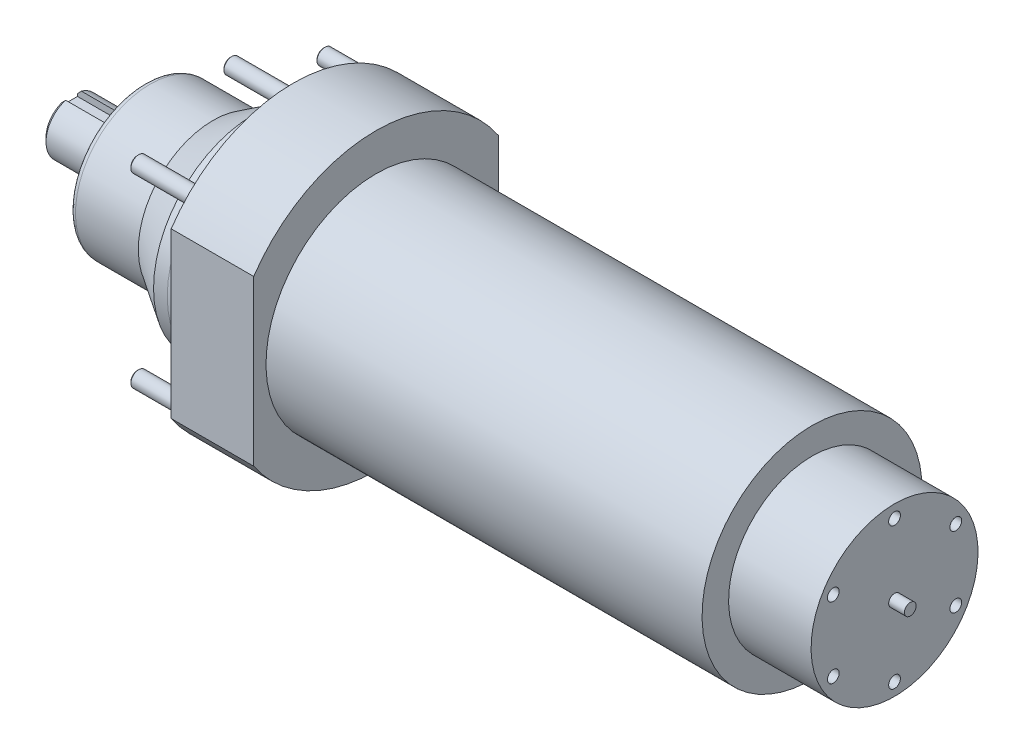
ISO-10303-21;
HEADER;
FILE_DESCRIPTION(('STEP AP214'),'2;1');
FILE_NAME('part.step','',(''),(''),'','','');
FILE_SCHEMA(('AUTOMOTIVE_DESIGN { 1 0 10303 214 1 1 1 1 }'));
ENDSEC;
DATA;
#1=APPLICATION_CONTEXT('core data for automotive mechanical design processes');
#2=APPLICATION_PROTOCOL_DEFINITION('international standard','automotive_design',2000,#1);
#3=PRODUCT_CONTEXT('',#1,'mechanical');
#4=PRODUCT('Part','Part','',(#3));
#5=PRODUCT_RELATED_PRODUCT_CATEGORY('part','',(#4));
#6=PRODUCT_DEFINITION_FORMATION('','',#4);
#7=PRODUCT_DEFINITION_CONTEXT('part definition',#1,'design');
#8=PRODUCT_DEFINITION('design','',#6,#7);
#9=PRODUCT_DEFINITION_SHAPE('','',#8);
#10=(LENGTH_UNIT() NAMED_UNIT(*) SI_UNIT(.MILLI.,.METRE.));
#11=(NAMED_UNIT(*) PLANE_ANGLE_UNIT() SI_UNIT($,.RADIAN.));
#12=(NAMED_UNIT(*) SI_UNIT($,.STERADIAN.) SOLID_ANGLE_UNIT());
#13=UNCERTAINTY_MEASURE_WITH_UNIT(LENGTH_MEASURE(1.E-05),#10,'distance_accuracy_value','');
#14=(GEOMETRIC_REPRESENTATION_CONTEXT(3) GLOBAL_UNCERTAINTY_ASSIGNED_CONTEXT((#13)) GLOBAL_UNIT_ASSIGNED_CONTEXT((#10,
#11,#12)) REPRESENTATION_CONTEXT('',''));
#15=CARTESIAN_POINT('',(0.,0.,0.));
#16=DIRECTION('',(0.,0.,1.));
#17=DIRECTION('',(1.,0.,0.));
#18=AXIS2_PLACEMENT_3D('',#15,#16,#17);
#19=CARTESIAN_POINT('',(80.,0.,0.));
#20=DIRECTION('',(1.,0.,0.));
#21=DIRECTION('',(0.,1.,0.));
#22=AXIS2_PLACEMENT_3D('',#19,#20,#21);
#23=CYLINDRICAL_SURFACE('',#22,75.);
#24=CARTESIAN_POINT('',(-230.247442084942,0.,0.));
#25=DIRECTION('',(1.,0.,0.));
#26=DIRECTION('',(0.,1.,0.));
#27=AXIS2_PLACEMENT_3D('',#24,#25,#26);
#28=CIRCLE('',#27,75.);
#29=CARTESIAN_POINT('',(-230.247442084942,-41.832254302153,62.25));
#30=VERTEX_POINT('',#29);
#31=CARTESIAN_POINT('',(-230.247442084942,-41.832254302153,-62.25));
#32=VERTEX_POINT('',#31);
#33=EDGE_CURVE('E117',#30,#32,#28,.T.);
#34=ORIENTED_EDGE('',*,*,#33,.T.);
#35=DIRECTION('',(1.,0.,0.));
#36=VECTOR('',#35,1.);
#37=CARTESIAN_POINT('',(-344.247442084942,-41.832254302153,-62.25));
#38=LINE('',#37,#36);
#39=CARTESIAN_POINT('',(-188.247442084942,-41.832254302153,-62.25));
#40=VERTEX_POINT('',#39);
#41=EDGE_CURVE('E43',#32,#40,#38,.T.);
#42=ORIENTED_EDGE('',*,*,#41,.T.);
#43=CARTESIAN_POINT('',(-188.247442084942,0.,0.));
#44=DIRECTION('',(1.,0.,0.));
#45=DIRECTION('',(0.,1.,0.));
#46=AXIS2_PLACEMENT_3D('',#43,#44,#45);
#47=CIRCLE('',#46,75.);
#48=CARTESIAN_POINT('',(-188.247442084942,-41.832254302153,62.25));
#49=VERTEX_POINT('',#48);
#50=EDGE_CURVE('E112',#49,#40,#47,.T.);
#51=ORIENTED_EDGE('',*,*,#50,.F.);
#52=DIRECTION('',(1.,0.,0.));
#53=VECTOR('',#52,1.);
#54=CARTESIAN_POINT('',(-344.247442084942,-41.832254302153,62.25));
#55=LINE('',#54,#53);
#56=EDGE_CURVE('E544',#30,#49,#55,.T.);
#57=ORIENTED_EDGE('',*,*,#56,.F.);
#58=EDGE_LOOP('',(#34,#42,#51,#57));
#59=FACE_BOUND('',#58,.T.);
#60=ADVANCED_FACE('F28',(#59),#23,.T.);
#61=CARTESIAN_POINT('',(-188.247442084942,75.,0.));
#62=DIRECTION('',(-1.,0.,0.));
#63=DIRECTION('',(0.,-1.,0.));
#64=AXIS2_PLACEMENT_3D('',#61,#62,#63);
#65=PLANE('',#64);
#66=CARTESIAN_POINT('',(-188.247442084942,0.,0.));
#67=DIRECTION('',(1.,0.,0.));
#68=DIRECTION('',(0.,1.,0.));
#69=AXIS2_PLACEMENT_3D('',#66,#67,#68);
#70=CIRCLE('',#69,56.);
#71=CARTESIAN_POINT('',(-188.247442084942,56.,0.));
#72=VERTEX_POINT('',#71);
#73=EDGE_CURVE('E119',#72,#72,#70,.T.);
#74=ORIENTED_EDGE('',*,*,#73,.F.);
#75=EDGE_LOOP('',(#74));
#76=FACE_BOUND('',#75,.T.);
#77=ORIENTED_EDGE('',*,*,#50,.T.);
#78=DIRECTION('',(0.,-1.,0.));
#79=VECTOR('',#78,1.);
#80=CARTESIAN_POINT('',(-188.247442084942,41.832254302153,-62.25));
#81=LINE('',#80,#79);
#82=CARTESIAN_POINT('',(-188.247442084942,41.832254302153,-62.25));
#83=VERTEX_POINT('',#82);
#84=EDGE_CURVE('E101',#83,#40,#81,.T.);
#85=ORIENTED_EDGE('',*,*,#84,.F.);
#86=CARTESIAN_POINT('',(-188.247442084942,41.8322543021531,62.25));
#87=VERTEX_POINT('',#86);
#88=EDGE_CURVE('E109',#83,#87,#47,.T.);
#89=ORIENTED_EDGE('',*,*,#88,.T.);
#90=DIRECTION('',(0.,-1.,0.));
#91=VECTOR('',#90,1.);
#92=CARTESIAN_POINT('',(-188.247442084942,41.8322543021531,62.25));
#93=LINE('',#92,#91);
#94=EDGE_CURVE('E546',#87,#49,#93,.T.);
#95=ORIENTED_EDGE('',*,*,#94,.T.);
#96=EDGE_LOOP('',(#77,#85,#89,#95));
#97=FACE_BOUND('',#96,.T.);
#98=ADVANCED_FACE('F107',(#76,#97),#65,.F.);
#99=ORIENTED_EDGE('',*,*,#88,.F.);
#100=DIRECTION('',(1.,0.,0.));
#101=VECTOR('',#100,1.);
#102=CARTESIAN_POINT('',(-344.247442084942,41.8322543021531,-62.25));
#103=LINE('',#102,#101);
#104=CARTESIAN_POINT('',(-230.247442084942,41.8322543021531,-62.25));
#105=VERTEX_POINT('',#104);
#106=EDGE_CURVE('E98',#105,#83,#103,.T.);
#107=ORIENTED_EDGE('',*,*,#106,.F.);
#108=CARTESIAN_POINT('',(-230.247442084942,41.832254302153,62.25));
#109=VERTEX_POINT('',#108);
#110=EDGE_CURVE('E51',#105,#109,#28,.T.);
#111=ORIENTED_EDGE('',*,*,#110,.T.);
#112=DIRECTION('',(1.,0.,0.));
#113=VECTOR('',#112,1.);
#114=CARTESIAN_POINT('',(-344.247442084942,41.8322543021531,62.25));
#115=LINE('',#114,#113);
#116=EDGE_CURVE('E116',#109,#87,#115,.T.);
#117=ORIENTED_EDGE('',*,*,#116,.T.);
#118=EDGE_LOOP('',(#99,#107,#111,#117));
#119=FACE_BOUND('',#118,.T.);
#120=ADVANCED_FACE('F115',(#119),#23,.T.);
#121=CARTESIAN_POINT('',(-230.247442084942,52.5,0.));
#122=DIRECTION('',(1.,0.,0.));
#123=DIRECTION('',(0.,1.,0.));
#124=AXIS2_PLACEMENT_3D('',#121,#122,#123);
#125=PLANE('',#124);
#126=CARTESIAN_POINT('',(-230.247442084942,-47.3761543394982,47.3761543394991));
#127=DIRECTION('',(1.,0.,0.));
#128=DIRECTION('',(0.,1.,0.));
#129=AXIS2_PLACEMENT_3D('',#126,#127,#128);
#130=CIRCLE('',#129,4.00000000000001);
#131=CARTESIAN_POINT('',(-230.247442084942,-43.3761543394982,47.3761543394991));
#132=VERTEX_POINT('',#131);
#133=EDGE_CURVE('E319',#132,#132,#130,.T.);
#134=ORIENTED_EDGE('',*,*,#133,.T.);
#135=EDGE_LOOP('',(#134));
#136=FACE_BOUND('',#135,.T.);
#137=CARTESIAN_POINT('',(-230.247442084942,-67.,4.67858770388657E-13));
#138=DIRECTION('',(1.,0.,0.));
#139=DIRECTION('',(0.,1.,0.));
#140=AXIS2_PLACEMENT_3D('',#137,#138,#139);
#141=CIRCLE('',#140,4.);
#142=CARTESIAN_POINT('',(-230.247442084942,-63.,4.67858770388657E-13));
#143=VERTEX_POINT('',#142);
#144=EDGE_CURVE('E316',#143,#143,#141,.T.);
#145=ORIENTED_EDGE('',*,*,#144,.T.);
#146=EDGE_LOOP('',(#145));
#147=FACE_BOUND('',#146,.T.);
#148=CARTESIAN_POINT('',(-230.247442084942,-47.3761543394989,-47.3761543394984));
#149=DIRECTION('',(1.,0.,0.));
#150=DIRECTION('',(0.,1.,0.));
#151=AXIS2_PLACEMENT_3D('',#148,#149,#150);
#152=CIRCLE('',#151,4.00000000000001);
#153=CARTESIAN_POINT('',(-230.247442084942,-43.3761543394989,-47.3761543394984));
#154=VERTEX_POINT('',#153);
#155=EDGE_CURVE('E313',#154,#154,#152,.T.);
#156=ORIENTED_EDGE('',*,*,#155,.T.);
#157=EDGE_LOOP('',(#156));
#158=FACE_BOUND('',#157,.T.);
#159=CARTESIAN_POINT('',(-230.247442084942,47.3761543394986,-47.3761543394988));
#160=DIRECTION('',(1.,0.,0.));
#161=DIRECTION('',(0.,1.,0.));
#162=AXIS2_PLACEMENT_3D('',#159,#160,#161);
#163=CIRCLE('',#162,4.);
#164=CARTESIAN_POINT('',(-230.247442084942,51.3761543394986,-47.3761543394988));
#165=VERTEX_POINT('',#164);
#166=EDGE_CURVE('E310',#165,#165,#163,.T.);
#167=ORIENTED_EDGE('',*,*,#166,.T.);
#168=EDGE_LOOP('',(#167));
#169=FACE_BOUND('',#168,.T.);
#170=CARTESIAN_POINT('',(-230.247442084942,67.,0.));
#171=DIRECTION('',(1.,0.,0.));
#172=DIRECTION('',(0.,1.,0.));
#173=AXIS2_PLACEMENT_3D('',#170,#171,#172);
#174=CIRCLE('',#173,4.);
#175=CARTESIAN_POINT('',(-230.247442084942,71.,0.));
#176=VERTEX_POINT('',#175);
#177=EDGE_CURVE('E307',#176,#176,#174,.T.);
#178=ORIENTED_EDGE('',*,*,#177,.T.);
#179=EDGE_LOOP('',(#178));
#180=FACE_BOUND('',#179,.T.);
#181=CARTESIAN_POINT('',(-230.247442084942,47.3761543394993,47.3761543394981));
#182=DIRECTION('',(1.,0.,0.));
#183=DIRECTION('',(0.,1.,0.));
#184=AXIS2_PLACEMENT_3D('',#181,#182,#183);
#185=CIRCLE('',#184,4.);
#186=CARTESIAN_POINT('',(-230.247442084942,51.3761543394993,47.3761543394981));
#187=VERTEX_POINT('',#186);
#188=EDGE_CURVE('E303',#187,#187,#185,.T.);
#189=ORIENTED_EDGE('',*,*,#188,.T.);
#190=EDGE_LOOP('',(#189));
#191=FACE_BOUND('',#190,.T.);
#192=CARTESIAN_POINT('',(-230.247442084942,0.,0.));
#193=DIRECTION('',(1.,0.,0.));
#194=DIRECTION('',(0.,1.,0.));
#195=AXIS2_PLACEMENT_3D('',#192,#193,#194);
#196=CIRCLE('',#195,52.5);
#197=CARTESIAN_POINT('',(-230.247442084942,52.5,0.));
#198=VERTEX_POINT('',#197);
#199=EDGE_CURVE('E279',#198,#198,#196,.T.);
#200=ORIENTED_EDGE('',*,*,#199,.T.);
#201=EDGE_LOOP('',(#200));
#202=FACE_BOUND('',#201,.T.);
#203=ORIENTED_EDGE('',*,*,#110,.F.);
#204=DIRECTION('',(0.,-1.,0.));
#205=VECTOR('',#204,1.);
#206=CARTESIAN_POINT('',(-230.247442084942,52.5,-62.25));
#207=LINE('',#206,#205);
#208=EDGE_CURVE('E102',#105,#32,#207,.T.);
#209=ORIENTED_EDGE('',*,*,#208,.T.);
#210=ORIENTED_EDGE('',*,*,#33,.F.);
#211=DIRECTION('',(0.,-1.,0.));
#212=VECTOR('',#211,1.);
#213=CARTESIAN_POINT('',(-230.247442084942,52.5,62.25));
#214=LINE('',#213,#212);
#215=EDGE_CURVE('E291',#109,#30,#214,.T.);
#216=ORIENTED_EDGE('',*,*,#215,.F.);
#217=EDGE_LOOP('',(#203,#209,#210,#216));
#218=FACE_BOUND('',#217,.T.);
#219=ADVANCED_FACE('F194',(#136,#147,#158,#169,#180,#191,#202,#218),#125,.F.);
#220=CARTESIAN_POINT('',(75.7525579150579,42.5,0.));
#221=DIRECTION('',(-1.,0.,0.));
#222=DIRECTION('',(0.,-1.,0.));
#223=AXIS2_PLACEMENT_3D('',#220,#221,#222);
#224=PLANE('',#223);
#225=CARTESIAN_POINT('',(75.7525579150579,-17.9999999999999,-31.1769145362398));
#226=DIRECTION('',(1.,0.,0.));
#227=DIRECTION('',(0.,0.499999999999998,-0.86602540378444));
#228=AXIS2_PLACEMENT_3D('',#225,#226,#227);
#229=CIRCLE('',#228,3.);
#230=CARTESIAN_POINT('',(75.7525579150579,-16.4999999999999,-33.7749907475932));
#231=VERTEX_POINT('',#230);
#232=EDGE_CURVE('E306',#231,#231,#229,.T.);
#233=ORIENTED_EDGE('',*,*,#232,.F.);
#234=EDGE_LOOP('',(#233));
#235=FACE_BOUND('',#234,.T.);
#236=CARTESIAN_POINT('',(75.7525579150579,36.,-2.42861286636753E-13));
#237=DIRECTION('',(1.,0.,0.));
#238=DIRECTION('',(0.,0.499999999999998,-0.86602540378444));
#239=AXIS2_PLACEMENT_3D('',#236,#237,#238);
#240=CIRCLE('',#239,3.00000000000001);
#241=CARTESIAN_POINT('',(75.7525579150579,37.5,-2.59807621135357));
#242=VERTEX_POINT('',#241);
#243=EDGE_CURVE('E582',#242,#242,#240,.T.);
#244=ORIENTED_EDGE('',*,*,#243,.F.);
#245=EDGE_LOOP('',(#244));
#246=FACE_BOUND('',#245,.T.);
#247=CARTESIAN_POINT('',(75.7525579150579,-17.9999999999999,31.1769145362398));
#248=DIRECTION('',(1.,0.,0.));
#249=DIRECTION('',(0.,0.499999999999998,-0.86602540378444));
#250=AXIS2_PLACEMENT_3D('',#247,#248,#249);
#251=CIRCLE('',#250,3.);
#252=CARTESIAN_POINT('',(75.7525579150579,-16.4999999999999,28.5788383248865));
#253=VERTEX_POINT('',#252);
#254=EDGE_CURVE('E576',#253,#253,#251,.T.);
#255=ORIENTED_EDGE('',*,*,#254,.F.);
#256=EDGE_LOOP('',(#255));
#257=FACE_BOUND('',#256,.T.);
#258=CARTESIAN_POINT('',(75.7525579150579,18.0000000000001,-31.1769145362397));
#259=DIRECTION('',(1.,0.,0.));
#260=DIRECTION('',(0.,1.,0.));
#261=AXIS2_PLACEMENT_3D('',#258,#259,#260);
#262=CIRCLE('',#261,3.);
#263=CARTESIAN_POINT('',(75.7525579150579,21.0000000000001,-31.1769145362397));
#264=VERTEX_POINT('',#263);
#265=EDGE_CURVE('E564',#264,#264,#262,.T.);
#266=ORIENTED_EDGE('',*,*,#265,.F.);
#267=EDGE_LOOP('',(#266));
#268=FACE_BOUND('',#267,.T.);
#269=CARTESIAN_POINT('',(75.7525579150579,18.0000000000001,31.1769145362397));
#270=DIRECTION('',(1.,0.,0.));
#271=DIRECTION('',(0.,1.,0.));
#272=AXIS2_PLACEMENT_3D('',#269,#270,#271);
#273=CIRCLE('',#272,3.00000000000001);
#274=CARTESIAN_POINT('',(75.7525579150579,21.0000000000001,31.1769145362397));
#275=VERTEX_POINT('',#274);
#276=EDGE_CURVE('E558',#275,#275,#273,.T.);
#277=ORIENTED_EDGE('',*,*,#276,.F.);
#278=EDGE_LOOP('',(#277));
#279=FACE_BOUND('',#278,.T.);
#280=CARTESIAN_POINT('',(75.7525579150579,-36.,0.));
#281=DIRECTION('',(1.,0.,0.));
#282=DIRECTION('',(0.,1.,0.));
#283=AXIS2_PLACEMENT_3D('',#280,#281,#282);
#284=CIRCLE('',#283,3.);
#285=CARTESIAN_POINT('',(75.7525579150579,-33.,0.));
#286=VERTEX_POINT('',#285);
#287=EDGE_CURVE('E552',#286,#286,#284,.T.);
#288=ORIENTED_EDGE('',*,*,#287,.F.);
#289=EDGE_LOOP('',(#288));
#290=FACE_BOUND('',#289,.T.);
#291=CARTESIAN_POINT('',(75.7525579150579,0.,0.));
#292=DIRECTION('',(1.,0.,0.));
#293=DIRECTION('',(0.,1.,0.));
#294=AXIS2_PLACEMENT_3D('',#291,#292,#293);
#295=CIRCLE('',#294,42.5);
#296=CARTESIAN_POINT('',(75.7525579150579,42.5,0.));
#297=VERTEX_POINT('',#296);
#298=EDGE_CURVE('E132',#297,#297,#295,.T.);
#299=ORIENTED_EDGE('',*,*,#298,.T.);
#300=EDGE_LOOP('',(#299));
#301=FACE_BOUND('',#300,.T.);
#302=CARTESIAN_POINT('',(75.7525579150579,0.,0.));
#303=DIRECTION('',(-1.,0.,0.));
#304=DIRECTION('',(0.,-1.,0.));
#305=AXIS2_PLACEMENT_3D('',#302,#303,#304);
#306=CIRCLE('',#305,3.);
#307=CARTESIAN_POINT('',(75.7525579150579,-3.00000000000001,0.));
#308=VERTEX_POINT('',#307);
#309=EDGE_CURVE('E294',#308,#308,#306,.F.);
#310=ORIENTED_EDGE('',*,*,#309,.F.);
#311=EDGE_LOOP('',(#310));
#312=FACE_BOUND('',#311,.T.);
#313=ADVANCED_FACE('F30',(#235,#246,#257,#268,#279,#290,#301,#312),#224,.F.);
#314=CARTESIAN_POINT('',(80.,0.,0.));
#315=DIRECTION('',(1.,0.,0.));
#316=DIRECTION('',(0.,1.,0.));
#317=AXIS2_PLACEMENT_3D('',#314,#315,#316);
#318=CYLINDRICAL_SURFACE('',#317,14.);
#319=CARTESIAN_POINT('',(-309.247442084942,0.,0.));
#320=DIRECTION('',(1.,0.,0.));
#321=DIRECTION('',(0.,1.,0.));
#322=AXIS2_PLACEMENT_3D('',#319,#320,#321);
#323=CIRCLE('',#322,14.);
#324=CARTESIAN_POINT('',(-309.247442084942,14.0000000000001,0.));
#325=VERTEX_POINT('',#324);
#326=EDGE_CURVE('E250',#325,#325,#323,.T.);
#327=ORIENTED_EDGE('',*,*,#326,.F.);
#328=EDGE_LOOP('',(#327));
#329=FACE_BOUND('',#328,.T.);
#330=DIRECTION('',(1.,0.,0.));
#331=VECTOR('',#330,1.);
#332=CARTESIAN_POINT('',(80.,13.4164078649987,4.));
#333=LINE('',#332,#331);
#334=CARTESIAN_POINT('',(-314.676056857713,13.4164078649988,4.));
#335=VERTEX_POINT('',#334);
#336=CARTESIAN_POINT('',(-342.247442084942,13.4164078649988,4.));
#337=VERTEX_POINT('',#336);
#338=EDGE_CURVE('E256',#335,#337,#333,.F.);
#339=ORIENTED_EDGE('',*,*,#338,.T.);
#340=CARTESIAN_POINT('',(-342.247442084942,0.,0.));
#341=DIRECTION('',(1.,0.,0.));
#342=DIRECTION('',(0.,1.,0.));
#343=AXIS2_PLACEMENT_3D('',#340,#341,#342);
#344=CIRCLE('',#343,14.);
#345=CARTESIAN_POINT('',(-342.247442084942,13.4164078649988,-4.));
#346=VERTEX_POINT('',#345);
#347=EDGE_CURVE('E147',#337,#346,#344,.T.);
#348=ORIENTED_EDGE('',*,*,#347,.T.);
#349=DIRECTION('',(1.,0.,0.));
#350=VECTOR('',#349,1.);
#351=CARTESIAN_POINT('',(80.,13.4164078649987,-4.));
#352=LINE('',#351,#350);
#353=CARTESIAN_POINT('',(-314.676056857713,13.4164078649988,-4.));
#354=VERTEX_POINT('',#353);
#355=EDGE_CURVE('E251',#354,#346,#352,.F.);
#356=ORIENTED_EDGE('',*,*,#355,.F.);
#357=CARTESIAN_POINT('',(-314.676056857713,13.4164078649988,-4.));
#358=CARTESIAN_POINT('',(-314.658750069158,13.4692322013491,-3.8228389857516));
#359=CARTESIAN_POINT('',(-314.643537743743,13.5185898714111,-3.64445546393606));
#360=CARTESIAN_POINT('',(-314.616658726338,13.6102469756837,-3.2856391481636));
#361=CARTESIAN_POINT('',(-314.604991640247,13.652547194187,-3.10520658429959));
#362=CARTESIAN_POINT('',(-314.584559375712,13.7299644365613,-2.74270387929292));
#363=CARTESIAN_POINT('',(-314.575793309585,13.7650836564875,-2.56063425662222));
#364=CARTESIAN_POINT('',(-314.560663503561,13.828076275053,-2.19515432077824));
#365=CARTESIAN_POINT('',(-314.554299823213,13.8559494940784,-2.01174397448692));
#366=CARTESIAN_POINT('',(-314.538438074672,13.9274563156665,-1.46870401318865));
#367=CARTESIAN_POINT('',(-314.531725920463,13.9608221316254,-1.10758584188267));
#368=CARTESIAN_POINT('',(-314.52401824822,13.9994299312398,-0.383824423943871));
#369=CARTESIAN_POINT('',(-314.523022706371,14.004672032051,-0.021181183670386));
#370=CARTESIAN_POINT('',(-314.526231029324,13.9883697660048,0.647828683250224));
#371=CARTESIAN_POINT('',(-314.529661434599,13.9708074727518,0.954302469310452));
#372=CARTESIAN_POINT('',(-314.541128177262,13.9155957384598,1.56532368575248));
#373=CARTESIAN_POINT('',(-314.549163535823,13.8779505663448,1.86987151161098));
#374=CARTESIAN_POINT('',(-314.565888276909,13.8061013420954,2.32724241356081));
#375=CARTESIAN_POINT('',(-314.572330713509,13.7792387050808,2.48133710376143));
#376=CARTESIAN_POINT('',(-314.587084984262,13.7203841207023,2.78845837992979));
#377=CARTESIAN_POINT('',(-314.595396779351,13.6883922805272,2.94148498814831));
#378=CARTESIAN_POINT('',(-314.614217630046,13.6193176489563,3.24632386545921));
#379=CARTESIAN_POINT('',(-314.624727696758,13.5822325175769,3.39813554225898));
#380=CARTESIAN_POINT('',(-314.648344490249,13.5030557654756,3.70025572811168));
#381=CARTESIAN_POINT('',(-314.661451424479,13.4609637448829,3.85056411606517));
#382=CARTESIAN_POINT('',(-314.676056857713,13.4164078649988,4.));
#383=B_SPLINE_CURVE_WITH_KNOTS('',3,(#357,#358,#359,#360,#361,#362,#363,#364,#365,#366,#367,
#368,#369,#370,#371,#372,#373,#374,#375,#376,#377,#378,#379,#380,#381,#382),.UNSPECIFIED.,.F.,
.F.,(4,2,2,2,2,2,2,2,2,2,2,2,4),(0.,0.556960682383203,1.11385942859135,1.67058761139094,
2.2273295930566,3.31424005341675,4.40114598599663,5.32147662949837,6.24161172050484,
6.71118445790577,7.18074738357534,7.65052676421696,8.12034368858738),.UNSPECIFIED.);
#384=EDGE_CURVE('E139',#354,#335,#383,.T.);
#385=ORIENTED_EDGE('',*,*,#384,.T.);
#386=EDGE_LOOP('',(#339,#348,#356,#385));
#387=FACE_BOUND('',#386,.T.);
#388=ADVANCED_FACE('F149',(#329,#387),#318,.T.);
#389=CARTESIAN_POINT('',(-344.247442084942,0.,0.));
#390=DIRECTION('',(1.,0.,0.));
#391=DIRECTION('',(0.,1.,0.));
#392=AXIS2_PLACEMENT_3D('',#389,#390,#391);
#393=PLANE('',#392);
#394=CARTESIAN_POINT('',(-344.247442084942,0.,0.));
#395=DIRECTION('',(-1.,0.,0.));
#396=DIRECTION('',(0.,-1.,0.));
#397=AXIS2_PLACEMENT_3D('',#394,#395,#396);
#398=CIRCLE('',#397,3.4);
#399=CARTESIAN_POINT('',(-344.247442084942,-3.39999999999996,0.));
#400=VERTEX_POINT('',#399);
#401=EDGE_CURVE('E570',#400,#400,#398,.T.);
#402=ORIENTED_EDGE('',*,*,#401,.F.);
#403=EDGE_LOOP('',(#402));
#404=FACE_BOUND('',#403,.T.);
#405=DIRECTION('',(0.,-1.,0.));
#406=VECTOR('',#405,1.);
#407=CARTESIAN_POINT('',(-344.247442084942,0.,-4.));
#408=LINE('',#407,#406);
#409=CARTESIAN_POINT('',(-344.247442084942,11.3137084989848,-4.));
#410=VERTEX_POINT('',#409);
#411=CARTESIAN_POINT('',(-344.247442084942,10.0682154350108,-4.));
#412=VERTEX_POINT('',#411);
#413=EDGE_CURVE('E137',#410,#412,#408,.T.);
#414=ORIENTED_EDGE('',*,*,#413,.F.);
#415=CARTESIAN_POINT('',(-344.247442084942,0.,0.));
#416=DIRECTION('',(1.,0.,0.));
#417=DIRECTION('',(0.,1.,0.));
#418=AXIS2_PLACEMENT_3D('',#415,#416,#417);
#419=CIRCLE('',#418,12.);
#420=CARTESIAN_POINT('',(-344.247442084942,11.3137084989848,4.));
#421=VERTEX_POINT('',#420);
#422=EDGE_CURVE('E506',#410,#421,#419,.F.);
#423=ORIENTED_EDGE('',*,*,#422,.T.);
#424=DIRECTION('',(0.,-1.,0.));
#425=VECTOR('',#424,1.);
#426=CARTESIAN_POINT('',(-344.247442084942,0.,4.));
#427=LINE('',#426,#425);
#428=CARTESIAN_POINT('',(-344.247442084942,10.0682154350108,4.));
#429=VERTEX_POINT('',#428);
#430=EDGE_CURVE('E135',#421,#429,#427,.T.);
#431=ORIENTED_EDGE('',*,*,#430,.T.);
#432=DIRECTION('',(0.,0.,1.));
#433=VECTOR('',#432,1.);
#434=CARTESIAN_POINT('',(-344.247442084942,10.0682154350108,-4.));
#435=LINE('',#434,#433);
#436=EDGE_CURVE('E523',#412,#429,#435,.T.);
#437=ORIENTED_EDGE('',*,*,#436,.F.);
#438=EDGE_LOOP('',(#414,#423,#431,#437));
#439=FACE_BOUND('',#438,.T.);
#440=ADVANCED_FACE('F168',(#404,#439),#393,.F.);
#441=CARTESIAN_POINT('',(80.,0.,0.));
#442=DIRECTION('',(1.,0.,0.));
#443=DIRECTION('',(0.,1.,0.));
#444=AXIS2_PLACEMENT_3D('',#441,#442,#443);
#445=CYLINDRICAL_SURFACE('',#444,42.5);
#446=ORIENTED_EDGE('',*,*,#298,.F.);
#447=EDGE_LOOP('',(#446));
#448=FACE_BOUND('',#447,.T.);
#449=CARTESIAN_POINT('',(33.7525579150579,0.,0.));
#450=DIRECTION('',(1.,0.,0.));
#451=DIRECTION('',(0.,1.,0.));
#452=AXIS2_PLACEMENT_3D('',#449,#450,#451);
#453=CIRCLE('',#452,42.5);
#454=CARTESIAN_POINT('',(33.7525579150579,42.5,0.));
#455=VERTEX_POINT('',#454);
#456=EDGE_CURVE('E129',#455,#455,#453,.T.);
#457=ORIENTED_EDGE('',*,*,#456,.T.);
#458=EDGE_LOOP('',(#457));
#459=FACE_BOUND('',#458,.T.);
#460=ADVANCED_FACE('F170',(#448,#459),#445,.T.);
#461=CARTESIAN_POINT('',(33.7525579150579,56.,0.));
#462=DIRECTION('',(-1.,0.,0.));
#463=DIRECTION('',(0.,-1.,0.));
#464=AXIS2_PLACEMENT_3D('',#461,#462,#463);
#465=PLANE('',#464);
#466=ORIENTED_EDGE('',*,*,#456,.F.);
#467=EDGE_LOOP('',(#466));
#468=FACE_BOUND('',#467,.T.);
#469=CARTESIAN_POINT('',(33.7525579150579,0.,0.));
#470=DIRECTION('',(1.,0.,0.));
#471=DIRECTION('',(0.,1.,0.));
#472=AXIS2_PLACEMENT_3D('',#469,#470,#471);
#473=CIRCLE('',#472,56.);
#474=CARTESIAN_POINT('',(33.7525579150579,56.,0.));
#475=VERTEX_POINT('',#474);
#476=EDGE_CURVE('E126',#475,#475,#473,.T.);
#477=ORIENTED_EDGE('',*,*,#476,.T.);
#478=EDGE_LOOP('',(#477));
#479=FACE_BOUND('',#478,.T.);
#480=ADVANCED_FACE('F177',(#468,#479),#465,.F.);
#481=CARTESIAN_POINT('',(80.,0.,0.));
#482=DIRECTION('',(1.,0.,0.));
#483=DIRECTION('',(0.,1.,0.));
#484=AXIS2_PLACEMENT_3D('',#481,#482,#483);
#485=CYLINDRICAL_SURFACE('',#484,56.);
#486=ORIENTED_EDGE('',*,*,#476,.F.);
#487=EDGE_LOOP('',(#486));
#488=FACE_BOUND('',#487,.T.);
#489=ORIENTED_EDGE('',*,*,#73,.T.);
#490=EDGE_LOOP('',(#489));
#491=FACE_BOUND('',#490,.T.);
#492=ADVANCED_FACE('F212',(#488,#491),#485,.T.);
#493=CARTESIAN_POINT('',(80.,0.,0.));
#494=DIRECTION('',(1.,0.,0.));
#495=DIRECTION('',(0.,1.,0.));
#496=AXIS2_PLACEMENT_3D('',#493,#494,#495);
#497=CYLINDRICAL_SURFACE('',#496,52.5);
#498=ORIENTED_EDGE('',*,*,#199,.F.);
#499=EDGE_LOOP('',(#498));
#500=FACE_BOUND('',#499,.T.);
#501=CARTESIAN_POINT('',(-236.247442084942,0.,0.));
#502=DIRECTION('',(1.,0.,0.));
#503=DIRECTION('',(0.,1.,0.));
#504=AXIS2_PLACEMENT_3D('',#501,#502,#503);
#505=CIRCLE('',#504,52.5);
#506=CARTESIAN_POINT('',(-236.247442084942,52.5,0.));
#507=VERTEX_POINT('',#506);
#508=EDGE_CURVE('E277',#507,#507,#505,.T.);
#509=ORIENTED_EDGE('',*,*,#508,.T.);
#510=EDGE_LOOP('',(#509));
#511=FACE_BOUND('',#510,.T.);
#512=ADVANCED_FACE('F208',(#500,#511),#497,.T.);
#513=CARTESIAN_POINT('',(-243.264683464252,0.,0.));
#514=DIRECTION('',(1.,0.,0.));
#515=DIRECTION('',(0.,1.,0.));
#516=AXIS2_PLACEMENT_3D('',#513,#514,#515);
#517=CONICAL_SURFACE('',#516,51.25,0.176283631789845);
#518=ORIENTED_EDGE('',*,*,#508,.F.);
#519=EDGE_LOOP('',(#518));
#520=FACE_BOUND('',#519,.T.);
#521=CARTESIAN_POINT('',(-243.264683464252,0.,0.));
#522=DIRECTION('',(1.,0.,0.));
#523=DIRECTION('',(0.,1.,0.));
#524=AXIS2_PLACEMENT_3D('',#521,#522,#523);
#525=CIRCLE('',#524,51.25);
#526=CARTESIAN_POINT('',(-243.264683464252,51.25,0.));
#527=VERTEX_POINT('',#526);
#528=EDGE_CURVE('E274',#527,#527,#525,.T.);
#529=ORIENTED_EDGE('',*,*,#528,.T.);
#530=EDGE_LOOP('',(#529));
#531=FACE_BOUND('',#530,.T.);
#532=ADVANCED_FACE('F211',(#520,#531),#517,.T.);
#533=CARTESIAN_POINT('',(80.,0.,0.));
#534=DIRECTION('',(1.,0.,0.));
#535=DIRECTION('',(0.,1.,0.));
#536=AXIS2_PLACEMENT_3D('',#533,#534,#535);
#537=CYLINDRICAL_SURFACE('',#536,51.25);
#538=CARTESIAN_POINT('',(-250.247442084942,0.,0.));
#539=DIRECTION('',(1.,0.,0.));
#540=DIRECTION('',(0.,1.,0.));
#541=AXIS2_PLACEMENT_3D('',#538,#539,#540);
#542=CIRCLE('',#541,51.25);
#543=CARTESIAN_POINT('',(-250.247442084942,51.25,0.));
#544=VERTEX_POINT('',#543);
#545=EDGE_CURVE('E271',#544,#544,#542,.T.);
#546=ORIENTED_EDGE('',*,*,#545,.T.);
#547=EDGE_LOOP('',(#546));
#548=FACE_BOUND('',#547,.T.);
#549=ORIENTED_EDGE('',*,*,#528,.F.);
#550=EDGE_LOOP('',(#549));
#551=FACE_BOUND('',#550,.T.);
#552=ADVANCED_FACE('F216',(#548,#551),#537,.T.);
#553=CARTESIAN_POINT('',(-250.247442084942,0.,0.));
#554=DIRECTION('',(1.,0.,0.));
#555=DIRECTION('',(0.,1.,0.));
#556=AXIS2_PLACEMENT_3D('',#553,#554,#555);
#557=CONICAL_SURFACE('',#556,51.25,0.56286823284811);
#558=CARTESIAN_POINT('',(-271.247442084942,0.,0.));
#559=DIRECTION('',(1.,0.,0.));
#560=DIRECTION('',(0.,1.,0.));
#561=AXIS2_PLACEMENT_3D('',#558,#559,#560);
#562=CIRCLE('',#561,38.);
#563=CARTESIAN_POINT('',(-271.247442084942,38.,0.));
#564=VERTEX_POINT('',#563);
#565=EDGE_CURVE('E268',#564,#564,#562,.T.);
#566=ORIENTED_EDGE('',*,*,#565,.T.);
#567=EDGE_LOOP('',(#566));
#568=FACE_BOUND('',#567,.T.);
#569=ORIENTED_EDGE('',*,*,#545,.F.);
#570=EDGE_LOOP('',(#569));
#571=FACE_BOUND('',#570,.T.);
#572=ADVANCED_FACE('F220',(#568,#571),#557,.T.);
#573=CARTESIAN_POINT('',(80.,0.,0.));
#574=DIRECTION('',(1.,0.,0.));
#575=DIRECTION('',(0.,1.,0.));
#576=AXIS2_PLACEMENT_3D('',#573,#574,#575);
#577=CYLINDRICAL_SURFACE('',#576,38.);
#578=ORIENTED_EDGE('',*,*,#565,.F.);
#579=EDGE_LOOP('',(#578));
#580=FACE_BOUND('',#579,.T.);
#581=CARTESIAN_POINT('',(-303.247442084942,0.,0.));
#582=DIRECTION('',(1.,0.,0.));
#583=DIRECTION('',(0.,1.,0.));
#584=AXIS2_PLACEMENT_3D('',#581,#582,#583);
#585=CIRCLE('',#584,38.);
#586=CARTESIAN_POINT('',(-303.247442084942,38.,0.));
#587=VERTEX_POINT('',#586);
#588=EDGE_CURVE('E265',#587,#587,#585,.T.);
#589=ORIENTED_EDGE('',*,*,#588,.T.);
#590=EDGE_LOOP('',(#589));
#591=FACE_BOUND('',#590,.T.);
#592=ADVANCED_FACE('F224',(#580,#591),#577,.T.);
#593=CARTESIAN_POINT('',(-303.247442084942,0.,0.));
#594=DIRECTION('',(1.,0.,0.));
#595=DIRECTION('',(0.,1.,0.));
#596=AXIS2_PLACEMENT_3D('',#593,#594,#595);
#597=TOROIDAL_SURFACE('',#596,35.,3.);
#598=CARTESIAN_POINT('',(-306.247442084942,0.,0.));
#599=DIRECTION('',(1.,0.,0.));
#600=DIRECTION('',(0.,1.,0.));
#601=AXIS2_PLACEMENT_3D('',#598,#599,#600);
#602=CIRCLE('',#601,35.);
#603=CARTESIAN_POINT('',(-306.247442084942,35.,0.));
#604=VERTEX_POINT('',#603);
#605=EDGE_CURVE('E262',#604,#604,#602,.T.);
#606=ORIENTED_EDGE('',*,*,#605,.T.);
#607=EDGE_LOOP('',(#606));
#608=FACE_BOUND('',#607,.T.);
#609=ORIENTED_EDGE('',*,*,#588,.F.);
#610=EDGE_LOOP('',(#609));
#611=FACE_BOUND('',#610,.T.);
#612=ADVANCED_FACE('F228',(#608,#611),#597,.T.);
#613=CARTESIAN_POINT('',(-306.247442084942,18.,0.));
#614=DIRECTION('',(1.,0.,0.));
#615=DIRECTION('',(0.,1.,0.));
#616=AXIS2_PLACEMENT_3D('',#613,#614,#615);
#617=PLANE('',#616);
#618=ORIENTED_EDGE('',*,*,#605,.F.);
#619=EDGE_LOOP('',(#618));
#620=FACE_BOUND('',#619,.T.);
#621=CARTESIAN_POINT('',(-306.247442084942,0.,0.));
#622=DIRECTION('',(1.,0.,0.));
#623=DIRECTION('',(0.,1.,0.));
#624=AXIS2_PLACEMENT_3D('',#621,#622,#623);
#625=CIRCLE('',#624,18.);
#626=CARTESIAN_POINT('',(-306.247442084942,18.,0.));
#627=VERTEX_POINT('',#626);
#628=EDGE_CURVE('E253',#627,#627,#625,.T.);
#629=ORIENTED_EDGE('',*,*,#628,.T.);
#630=EDGE_LOOP('',(#629));
#631=FACE_BOUND('',#630,.T.);
#632=ADVANCED_FACE('F232',(#620,#631),#617,.F.);
#633=CARTESIAN_POINT('',(80.,0.,0.));
#634=DIRECTION('',(1.,0.,0.));
#635=DIRECTION('',(0.,1.,0.));
#636=AXIS2_PLACEMENT_3D('',#633,#634,#635);
#637=CYLINDRICAL_SURFACE('',#636,18.);
#638=ORIENTED_EDGE('',*,*,#628,.F.);
#639=EDGE_LOOP('',(#638));
#640=FACE_BOUND('',#639,.T.);
#641=CARTESIAN_POINT('',(-309.247442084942,0.,0.));
#642=DIRECTION('',(1.,0.,0.));
#643=DIRECTION('',(0.,1.,0.));
#644=AXIS2_PLACEMENT_3D('',#641,#642,#643);
#645=CIRCLE('',#644,18.);
#646=CARTESIAN_POINT('',(-309.247442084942,18.0000000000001,0.));
#647=VERTEX_POINT('',#646);
#648=EDGE_CURVE('E247',#647,#647,#645,.T.);
#649=ORIENTED_EDGE('',*,*,#648,.T.);
#650=EDGE_LOOP('',(#649));
#651=FACE_BOUND('',#650,.T.);
#652=ADVANCED_FACE('F236',(#640,#651),#637,.T.);
#653=CARTESIAN_POINT('',(-309.247442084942,14.0000000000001,0.));
#654=DIRECTION('',(1.,0.,0.));
#655=DIRECTION('',(0.,1.,0.));
#656=AXIS2_PLACEMENT_3D('',#653,#654,#655);
#657=PLANE('',#656);
#658=ORIENTED_EDGE('',*,*,#648,.F.);
#659=EDGE_LOOP('',(#658));
#660=FACE_BOUND('',#659,.T.);
#661=ORIENTED_EDGE('',*,*,#326,.T.);
#662=EDGE_LOOP('',(#661));
#663=FACE_BOUND('',#662,.T.);
#664=ADVANCED_FACE('F159',(#660,#663),#657,.F.);
#665=CARTESIAN_POINT('',(-319.298242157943,14.9327789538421,-4.));
#666=DIRECTION('',(0.,0.,1.));
#667=DIRECTION('',(1.,0.,0.));
#668=AXIS2_PLACEMENT_3D('',#665,#666,#667);
#669=CYLINDRICAL_SURFACE('',#668,4.86456351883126);
#670=CARTESIAN_POINT('',(-319.298242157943,14.9327789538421,-4.));
#671=DIRECTION('',(0.,0.,1.));
#672=DIRECTION('',(1.,0.,0.));
#673=AXIS2_PLACEMENT_3D('',#670,#671,#672);
#674=CIRCLE('',#673,4.86456351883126);
#675=CARTESIAN_POINT('',(-319.298242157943,10.0682154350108,-4.));
#676=VERTEX_POINT('',#675);
#677=EDGE_CURVE('E520',#676,#354,#674,.T.);
#678=ORIENTED_EDGE('',*,*,#677,.F.);
#679=DIRECTION('',(0.,0.,1.));
#680=VECTOR('',#679,1.);
#681=CARTESIAN_POINT('',(-319.298242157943,10.0682154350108,-4.));
#682=LINE('',#681,#680);
#683=CARTESIAN_POINT('',(-319.298242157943,10.0682154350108,4.));
#684=VERTEX_POINT('',#683);
#685=EDGE_CURVE('E526',#676,#684,#682,.T.);
#686=ORIENTED_EDGE('',*,*,#685,.T.);
#687=CARTESIAN_POINT('',(-319.298242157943,14.9327789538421,4.));
#688=DIRECTION('',(0.,0.,1.));
#689=DIRECTION('',(1.,0.,0.));
#690=AXIS2_PLACEMENT_3D('',#687,#688,#689);
#691=CIRCLE('',#690,4.86456351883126);
#692=EDGE_CURVE('E528',#684,#335,#691,.T.);
#693=ORIENTED_EDGE('',*,*,#692,.T.);
#694=ORIENTED_EDGE('',*,*,#384,.F.);
#695=EDGE_LOOP('',(#678,#686,#693,#694));
#696=FACE_BOUND('',#695,.T.);
#697=ADVANCED_FACE('F153',(#696),#669,.F.);
#698=CARTESIAN_POINT('',(-319.298242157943,14.9327789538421,-4.));
#699=DIRECTION('',(0.,0.,1.));
#700=DIRECTION('',(1.,0.,0.));
#701=AXIS2_PLACEMENT_3D('',#698,#699,#700);
#702=PLANE('',#701);
#703=ORIENTED_EDGE('',*,*,#355,.T.);
#704=CARTESIAN_POINT('',(-342.247442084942,13.4164078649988,-4.));
#705=CARTESIAN_POINT('',(-342.414763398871,13.241806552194,-4.));
#706=CARTESIAN_POINT('',(-342.581947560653,13.0670736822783,-4.));
#707=CARTESIAN_POINT('',(-342.916002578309,12.7173101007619,-4.));
#708=CARTESIAN_POINT('',(-343.082873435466,12.5422793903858,-4.));
#709=CARTESIAN_POINT('',(-343.416264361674,12.1918838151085,-4.));
#710=CARTESIAN_POINT('',(-343.582784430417,12.0165189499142,-4.));
#711=CARTESIAN_POINT('',(-343.915425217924,11.6654095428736,-4.));
#712=CARTESIAN_POINT('',(-344.081545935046,11.4896649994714,-4.));
#713=CARTESIAN_POINT('',(-344.247442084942,11.3137084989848,-4.));
#714=B_SPLINE_CURVE_WITH_KNOTS('',3,(#704,#705,#706,#707,#708,#709,#710,#711,#712,#713),
.UNSPECIFIED.,.F.,.F.,(4,2,2,2,4),(0.,0.725491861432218,1.4509807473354,2.17647026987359,
2.90196277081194),.UNSPECIFIED.);
#715=EDGE_CURVE('E498',#346,#410,#714,.T.);
#716=ORIENTED_EDGE('',*,*,#715,.T.);
#717=ORIENTED_EDGE('',*,*,#413,.T.);
#718=DIRECTION('',(1.,0.,0.));
#719=VECTOR('',#718,1.);
#720=CARTESIAN_POINT('',(-344.247442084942,10.0682154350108,-4.));
#721=LINE('',#720,#719);
#722=EDGE_CURVE('E522',#412,#676,#721,.T.);
#723=ORIENTED_EDGE('',*,*,#722,.T.);
#724=ORIENTED_EDGE('',*,*,#677,.T.);
#725=EDGE_LOOP('',(#703,#716,#717,#723,#724));
#726=FACE_BOUND('',#725,.T.);
#727=ADVANCED_FACE('F158',(#726),#702,.T.);
#728=CARTESIAN_POINT('',(-319.298242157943,14.9327789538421,4.));
#729=DIRECTION('',(0.,0.,1.));
#730=DIRECTION('',(1.,0.,0.));
#731=AXIS2_PLACEMENT_3D('',#728,#729,#730);
#732=PLANE('',#731);
#733=ORIENTED_EDGE('',*,*,#430,.F.);
#734=CARTESIAN_POINT('',(-344.247442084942,11.3137084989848,4.));
#735=CARTESIAN_POINT('',(-344.081545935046,11.4896649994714,4.));
#736=CARTESIAN_POINT('',(-343.915425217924,11.6654095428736,4.));
#737=CARTESIAN_POINT('',(-343.582784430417,12.0165189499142,4.));
#738=CARTESIAN_POINT('',(-343.416264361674,12.1918838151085,4.));
#739=CARTESIAN_POINT('',(-343.082873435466,12.5422793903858,4.));
#740=CARTESIAN_POINT('',(-342.916002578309,12.7173101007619,4.));
#741=CARTESIAN_POINT('',(-342.581947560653,13.0670736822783,4.));
#742=CARTESIAN_POINT('',(-342.414763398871,13.241806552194,4.));
#743=CARTESIAN_POINT('',(-342.247442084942,13.4164078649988,4.));
#744=B_SPLINE_CURVE_WITH_KNOTS('',3,(#734,#735,#736,#737,#738,#739,#740,#741,#742,#743),
.UNSPECIFIED.,.F.,.F.,(4,2,2,2,4),(0.,0.725492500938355,1.45098202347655,2.17647090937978,
2.90196277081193),.UNSPECIFIED.);
#745=EDGE_CURVE('E299',#421,#337,#744,.T.);
#746=ORIENTED_EDGE('',*,*,#745,.T.);
#747=ORIENTED_EDGE('',*,*,#338,.F.);
#748=ORIENTED_EDGE('',*,*,#692,.F.);
#749=DIRECTION('',(1.,0.,0.));
#750=VECTOR('',#749,1.);
#751=CARTESIAN_POINT('',(-344.247442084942,10.0682154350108,4.));
#752=LINE('',#751,#750);
#753=EDGE_CURVE('E536',#429,#684,#752,.T.);
#754=ORIENTED_EDGE('',*,*,#753,.F.);
#755=EDGE_LOOP('',(#733,#746,#747,#748,#754));
#756=FACE_BOUND('',#755,.T.);
#757=ADVANCED_FACE('F166',(#756),#732,.F.);
#758=CARTESIAN_POINT('',(-344.247442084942,10.0682154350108,-4.));
#759=DIRECTION('',(0.,-1.,0.));
#760=DIRECTION('',(0.,0.,-1.));
#761=AXIS2_PLACEMENT_3D('',#758,#759,#760);
#762=PLANE('',#761);
#763=ORIENTED_EDGE('',*,*,#753,.T.);
#764=ORIENTED_EDGE('',*,*,#685,.F.);
#765=ORIENTED_EDGE('',*,*,#722,.F.);
#766=ORIENTED_EDGE('',*,*,#436,.T.);
#767=EDGE_LOOP('',(#763,#764,#765,#766));
#768=FACE_BOUND('',#767,.T.);
#769=ADVANCED_FACE('F163',(#768),#762,.F.);
#770=CARTESIAN_POINT('',(-342.247442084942,0.,0.));
#771=DIRECTION('',(1.,0.,0.));
#772=DIRECTION('',(0.,1.,0.));
#773=AXIS2_PLACEMENT_3D('',#770,#771,#772);
#774=CONICAL_SURFACE('',#773,14.,0.785398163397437);
#775=ORIENTED_EDGE('',*,*,#745,.F.);
#776=ORIENTED_EDGE('',*,*,#422,.F.);
#777=ORIENTED_EDGE('',*,*,#715,.F.);
#778=ORIENTED_EDGE('',*,*,#347,.F.);
#779=EDGE_LOOP('',(#775,#776,#777,#778));
#780=FACE_BOUND('',#779,.T.);
#781=ADVANCED_FACE('F165',(#780),#774,.T.);
#782=CARTESIAN_POINT('',(83.7525579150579,0.,0.));
#783=DIRECTION('',(-1.,0.,0.));
#784=DIRECTION('',(0.,-1.,0.));
#785=AXIS2_PLACEMENT_3D('',#782,#783,#784);
#786=CYLINDRICAL_SURFACE('',#785,3.);
#787=CARTESIAN_POINT('',(83.7525579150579,0.,0.));
#788=DIRECTION('',(1.,0.,0.));
#789=DIRECTION('',(0.,1.,0.));
#790=AXIS2_PLACEMENT_3D('',#787,#788,#789);
#791=CIRCLE('',#790,3.);
#792=CARTESIAN_POINT('',(83.7525579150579,2.99999999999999,0.));
#793=VERTEX_POINT('',#792);
#794=EDGE_CURVE('E539',#793,#793,#791,.T.);
#795=ORIENTED_EDGE('',*,*,#794,.F.);
#796=EDGE_LOOP('',(#795));
#797=FACE_BOUND('',#796,.T.);
#798=ORIENTED_EDGE('',*,*,#309,.T.);
#799=EDGE_LOOP('',(#798));
#800=FACE_BOUND('',#799,.T.);
#801=ADVANCED_FACE('F488',(#797,#800),#786,.T.);
#802=CARTESIAN_POINT('',(83.7525579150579,0.,0.));
#803=DIRECTION('',(1.,0.,0.));
#804=DIRECTION('',(0.,1.,0.));
#805=AXIS2_PLACEMENT_3D('',#802,#803,#804);
#806=PLANE('',#805);
#807=ORIENTED_EDGE('',*,*,#794,.T.);
#808=EDGE_LOOP('',(#807));
#809=FACE_BOUND('',#808,.T.);
#810=ADVANCED_FACE('F486',(#809),#806,.T.);
#811=CARTESIAN_POINT('',(-344.247442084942,41.8322543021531,62.25));
#812=DIRECTION('',(0.,0.,1.));
#813=DIRECTION('',(1.,0.,0.));
#814=AXIS2_PLACEMENT_3D('',#811,#812,#813);
#815=PLANE('',#814);
#816=ORIENTED_EDGE('',*,*,#215,.T.);
#817=ORIENTED_EDGE('',*,*,#56,.T.);
#818=ORIENTED_EDGE('',*,*,#94,.F.);
#819=ORIENTED_EDGE('',*,*,#116,.F.);
#820=EDGE_LOOP('',(#816,#817,#818,#819));
#821=FACE_BOUND('',#820,.T.);
#822=ADVANCED_FACE('F484',(#821),#815,.T.);
#823=CARTESIAN_POINT('',(-344.247442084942,41.8322543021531,-62.25));
#824=DIRECTION('',(0.,0.,1.));
#825=DIRECTION('',(0.,-1.,0.));
#826=AXIS2_PLACEMENT_3D('',#823,#824,#825);
#827=PLANE('',#826);
#828=ORIENTED_EDGE('',*,*,#106,.T.);
#829=ORIENTED_EDGE('',*,*,#84,.T.);
#830=ORIENTED_EDGE('',*,*,#41,.F.);
#831=ORIENTED_EDGE('',*,*,#208,.F.);
#832=EDGE_LOOP('',(#828,#829,#830,#831));
#833=FACE_BOUND('',#832,.T.);
#834=ADVANCED_FACE('F100',(#833),#827,.F.);
#835=CARTESIAN_POINT('',(55.7525579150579,-36.,0.));
#836=DIRECTION('',(1.,0.,0.));
#837=DIRECTION('',(0.,1.,0.));
#838=AXIS2_PLACEMENT_3D('',#835,#836,#837);
#839=CYLINDRICAL_SURFACE('',#838,3.);
#840=CARTESIAN_POINT('',(55.7525579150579,-36.,0.));
#841=DIRECTION('',(1.,0.,0.));
#842=DIRECTION('',(0.,1.,0.));
#843=AXIS2_PLACEMENT_3D('',#840,#841,#842);
#844=CIRCLE('',#843,3.);
#845=CARTESIAN_POINT('',(55.7525579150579,-33.,0.));
#846=VERTEX_POINT('',#845);
#847=EDGE_CURVE('E113',#846,#846,#844,.T.);
#848=ORIENTED_EDGE('',*,*,#847,.F.);
#849=EDGE_LOOP('',(#848));
#850=FACE_BOUND('',#849,.T.);
#851=ORIENTED_EDGE('',*,*,#287,.T.);
#852=EDGE_LOOP('',(#851));
#853=FACE_BOUND('',#852,.T.);
#854=ADVANCED_FACE('F477',(#850,#853),#839,.F.);
#855=CARTESIAN_POINT('',(55.7525579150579,-36.,0.));
#856=DIRECTION('',(1.,0.,0.));
#857=DIRECTION('',(0.,1.,0.));
#858=AXIS2_PLACEMENT_3D('',#855,#856,#857);
#859=PLANE('',#858);
#860=ORIENTED_EDGE('',*,*,#847,.T.);
#861=EDGE_LOOP('',(#860));
#862=FACE_BOUND('',#861,.T.);
#863=ADVANCED_FACE('F473',(#862),#859,.T.);
#864=CARTESIAN_POINT('',(55.7525579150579,18.0000000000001,31.1769145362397));
#865=DIRECTION('',(1.,0.,0.));
#866=DIRECTION('',(0.,1.,0.));
#867=AXIS2_PLACEMENT_3D('',#864,#865,#866);
#868=CYLINDRICAL_SURFACE('',#867,3.00000000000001);
#869=CARTESIAN_POINT('',(55.7525579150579,18.0000000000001,31.1769145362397));
#870=DIRECTION('',(1.,0.,0.));
#871=DIRECTION('',(0.,1.,0.));
#872=AXIS2_PLACEMENT_3D('',#869,#870,#871);
#873=CIRCLE('',#872,3.00000000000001);
#874=CARTESIAN_POINT('',(55.7525579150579,21.0000000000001,31.1769145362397));
#875=VERTEX_POINT('',#874);
#876=EDGE_CURVE('E555',#875,#875,#873,.T.);
#877=ORIENTED_EDGE('',*,*,#876,.F.);
#878=EDGE_LOOP('',(#877));
#879=FACE_BOUND('',#878,.T.);
#880=ORIENTED_EDGE('',*,*,#276,.T.);
#881=EDGE_LOOP('',(#880));
#882=FACE_BOUND('',#881,.T.);
#883=ADVANCED_FACE('F469',(#879,#882),#868,.F.);
#884=CARTESIAN_POINT('',(55.7525579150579,18.0000000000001,31.1769145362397));
#885=DIRECTION('',(1.,0.,0.));
#886=DIRECTION('',(0.,1.,0.));
#887=AXIS2_PLACEMENT_3D('',#884,#885,#886);
#888=PLANE('',#887);
#889=ORIENTED_EDGE('',*,*,#876,.T.);
#890=EDGE_LOOP('',(#889));
#891=FACE_BOUND('',#890,.T.);
#892=ADVANCED_FACE('F465',(#891),#888,.T.);
#893=CARTESIAN_POINT('',(55.7525579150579,18.0000000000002,-31.1769145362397));
#894=DIRECTION('',(1.,0.,0.));
#895=DIRECTION('',(0.,1.,0.));
#896=AXIS2_PLACEMENT_3D('',#893,#894,#895);
#897=CYLINDRICAL_SURFACE('',#896,3.);
#898=CARTESIAN_POINT('',(55.7525579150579,18.0000000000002,-31.1769145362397));
#899=DIRECTION('',(1.,0.,0.));
#900=DIRECTION('',(0.,1.,0.));
#901=AXIS2_PLACEMENT_3D('',#898,#899,#900);
#902=CIRCLE('',#901,3.);
#903=CARTESIAN_POINT('',(55.7525579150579,21.0000000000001,-31.1769145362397));
#904=VERTEX_POINT('',#903);
#905=EDGE_CURVE('E561',#904,#904,#902,.T.);
#906=ORIENTED_EDGE('',*,*,#905,.F.);
#907=EDGE_LOOP('',(#906));
#908=FACE_BOUND('',#907,.T.);
#909=ORIENTED_EDGE('',*,*,#265,.T.);
#910=EDGE_LOOP('',(#909));
#911=FACE_BOUND('',#910,.T.);
#912=ADVANCED_FACE('F461',(#908,#911),#897,.F.);
#913=CARTESIAN_POINT('',(55.7525579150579,18.0000000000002,-31.1769145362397));
#914=DIRECTION('',(1.,0.,0.));
#915=DIRECTION('',(0.,1.,0.));
#916=AXIS2_PLACEMENT_3D('',#913,#914,#915);
#917=PLANE('',#916);
#918=ORIENTED_EDGE('',*,*,#905,.T.);
#919=EDGE_LOOP('',(#918));
#920=FACE_BOUND('',#919,.T.);
#921=ADVANCED_FACE('F458',(#920),#917,.T.);
#922=CARTESIAN_POINT('',(-328.247442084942,0.,0.));
#923=DIRECTION('',(-1.,0.,0.));
#924=DIRECTION('',(0.,-1.,0.));
#925=AXIS2_PLACEMENT_3D('',#922,#923,#924);
#926=CYLINDRICAL_SURFACE('',#925,3.4);
#927=CARTESIAN_POINT('',(-328.247442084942,0.,0.));
#928=DIRECTION('',(-1.,0.,0.));
#929=DIRECTION('',(0.,-1.,0.));
#930=AXIS2_PLACEMENT_3D('',#927,#928,#929);
#931=CIRCLE('',#930,3.4);
#932=CARTESIAN_POINT('',(-328.247442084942,-3.39999999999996,0.));
#933=VERTEX_POINT('',#932);
#934=EDGE_CURVE('E567',#933,#933,#931,.T.);
#935=ORIENTED_EDGE('',*,*,#934,.F.);
#936=EDGE_LOOP('',(#935));
#937=FACE_BOUND('',#936,.T.);
#938=ORIENTED_EDGE('',*,*,#401,.T.);
#939=EDGE_LOOP('',(#938));
#940=FACE_BOUND('',#939,.T.);
#941=ADVANCED_FACE('F455',(#937,#940),#926,.F.);
#942=CARTESIAN_POINT('',(-328.247442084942,0.,0.));
#943=DIRECTION('',(-1.,0.,0.));
#944=DIRECTION('',(0.,-1.,0.));
#945=AXIS2_PLACEMENT_3D('',#942,#943,#944);
#946=PLANE('',#945);
#947=ORIENTED_EDGE('',*,*,#934,.T.);
#948=EDGE_LOOP('',(#947));
#949=FACE_BOUND('',#948,.T.);
#950=ADVANCED_FACE('F451',(#949),#946,.T.);
#951=CARTESIAN_POINT('',(55.7525579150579,-17.9999999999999,31.1769145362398));
#952=DIRECTION('',(1.,0.,0.));
#953=DIRECTION('',(0.,1.,0.));
#954=AXIS2_PLACEMENT_3D('',#951,#952,#953);
#955=CYLINDRICAL_SURFACE('',#954,3.);
#956=CARTESIAN_POINT('',(55.7525579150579,-17.9999999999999,31.1769145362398));
#957=DIRECTION('',(1.,0.,0.));
#958=DIRECTION('',(0.,0.499999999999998,-0.86602540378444));
#959=AXIS2_PLACEMENT_3D('',#956,#957,#958);
#960=CIRCLE('',#959,3.);
#961=CARTESIAN_POINT('',(55.7525579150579,-16.4999999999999,28.5788383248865));
#962=VERTEX_POINT('',#961);
#963=EDGE_CURVE('E573',#962,#962,#960,.T.);
#964=ORIENTED_EDGE('',*,*,#963,.F.);
#965=EDGE_LOOP('',(#964));
#966=FACE_BOUND('',#965,.T.);
#967=ORIENTED_EDGE('',*,*,#254,.T.);
#968=EDGE_LOOP('',(#967));
#969=FACE_BOUND('',#968,.T.);
#970=ADVANCED_FACE('F447',(#966,#969),#955,.F.);
#971=CARTESIAN_POINT('',(55.7525579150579,-17.9999999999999,31.1769145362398));
#972=DIRECTION('',(1.,0.,0.));
#973=DIRECTION('',(0.,0.499999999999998,-0.86602540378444));
#974=AXIS2_PLACEMENT_3D('',#971,#972,#973);
#975=PLANE('',#974);
#976=ORIENTED_EDGE('',*,*,#963,.T.);
#977=EDGE_LOOP('',(#976));
#978=FACE_BOUND('',#977,.T.);
#979=ADVANCED_FACE('F443',(#978),#975,.T.);
#980=CARTESIAN_POINT('',(55.7525579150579,36.,-2.42861286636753E-13));
#981=DIRECTION('',(1.,0.,0.));
#982=DIRECTION('',(0.,1.,0.));
#983=AXIS2_PLACEMENT_3D('',#980,#981,#982);
#984=CYLINDRICAL_SURFACE('',#983,3.00000000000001);
#985=CARTESIAN_POINT('',(55.7525579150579,36.,-2.42861286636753E-13));
#986=DIRECTION('',(1.,0.,0.));
#987=DIRECTION('',(0.,0.499999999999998,-0.86602540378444));
#988=AXIS2_PLACEMENT_3D('',#985,#986,#987);
#989=CIRCLE('',#988,3.00000000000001);
#990=CARTESIAN_POINT('',(55.7525579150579,37.5,-2.59807621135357));
#991=VERTEX_POINT('',#990);
#992=EDGE_CURVE('E579',#991,#991,#989,.T.);
#993=ORIENTED_EDGE('',*,*,#992,.F.);
#994=EDGE_LOOP('',(#993));
#995=FACE_BOUND('',#994,.T.);
#996=ORIENTED_EDGE('',*,*,#243,.T.);
#997=EDGE_LOOP('',(#996));
#998=FACE_BOUND('',#997,.T.);
#999=ADVANCED_FACE('F439',(#995,#998),#984,.F.);
#1000=CARTESIAN_POINT('',(55.7525579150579,36.,-2.42861286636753E-13));
#1001=DIRECTION('',(1.,0.,0.));
#1002=DIRECTION('',(0.,0.499999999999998,-0.86602540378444));
#1003=AXIS2_PLACEMENT_3D('',#1000,#1001,#1002);
#1004=PLANE('',#1003);
#1005=ORIENTED_EDGE('',*,*,#992,.T.);
#1006=EDGE_LOOP('',(#1005));
#1007=FACE_BOUND('',#1006,.T.);
#1008=ADVANCED_FACE('F435',(#1007),#1004,.T.);
#1009=CARTESIAN_POINT('',(55.7525579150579,-17.9999999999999,-31.1769145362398));
#1010=DIRECTION('',(1.,0.,0.));
#1011=DIRECTION('',(0.,1.,0.));
#1012=AXIS2_PLACEMENT_3D('',#1009,#1010,#1011);
#1013=CYLINDRICAL_SURFACE('',#1012,3.);
#1014=CARTESIAN_POINT('',(55.7525579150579,-17.9999999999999,-31.1769145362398));
#1015=DIRECTION('',(1.,0.,0.));
#1016=DIRECTION('',(0.,0.499999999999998,-0.86602540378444));
#1017=AXIS2_PLACEMENT_3D('',#1014,#1015,#1016);
#1018=CIRCLE('',#1017,3.);
#1019=CARTESIAN_POINT('',(55.7525579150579,-16.4999999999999,-33.7749907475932));
#1020=VERTEX_POINT('',#1019);
#1021=EDGE_CURVE('E585',#1020,#1020,#1018,.T.);
#1022=ORIENTED_EDGE('',*,*,#1021,.F.);
#1023=EDGE_LOOP('',(#1022));
#1024=FACE_BOUND('',#1023,.T.);
#1025=ORIENTED_EDGE('',*,*,#232,.T.);
#1026=EDGE_LOOP('',(#1025));
#1027=FACE_BOUND('',#1026,.T.);
#1028=ADVANCED_FACE('F431',(#1024,#1027),#1013,.F.);
#1029=CARTESIAN_POINT('',(55.7525579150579,-17.9999999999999,-31.1769145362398));
#1030=DIRECTION('',(1.,0.,0.));
#1031=DIRECTION('',(0.,0.499999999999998,-0.86602540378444));
#1032=AXIS2_PLACEMENT_3D('',#1029,#1030,#1031);
#1033=PLANE('',#1032);
#1034=ORIENTED_EDGE('',*,*,#1021,.T.);
#1035=EDGE_LOOP('',(#1034));
#1036=FACE_BOUND('',#1035,.T.);
#1037=ADVANCED_FACE('F427',(#1036),#1033,.T.);
#1038=CARTESIAN_POINT('',(-262.247442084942,47.3761543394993,47.3761543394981));
#1039=DIRECTION('',(1.,0.,0.));
#1040=DIRECTION('',(0.,1.,0.));
#1041=AXIS2_PLACEMENT_3D('',#1038,#1039,#1040);
#1042=CYLINDRICAL_SURFACE('',#1041,4.);
#1043=CARTESIAN_POINT('',(-261.647442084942,47.3761543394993,47.3761543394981));
#1044=DIRECTION('',(1.,0.,0.));
#1045=DIRECTION('',(0.,0.,-1.));
#1046=AXIS2_PLACEMENT_3D('',#1043,#1044,#1045);
#1047=CIRCLE('',#1046,4.);
#1048=CARTESIAN_POINT('',(-261.647442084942,47.3761543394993,43.3761543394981));
#1049=VERTEX_POINT('',#1048);
#1050=EDGE_CURVE('E332',#1049,#1049,#1047,.T.);
#1051=ORIENTED_EDGE('',*,*,#1050,.T.);
#1052=EDGE_LOOP('',(#1051));
#1053=FACE_BOUND('',#1052,.T.);
#1054=ORIENTED_EDGE('',*,*,#188,.F.);
#1055=EDGE_LOOP('',(#1054));
#1056=FACE_BOUND('',#1055,.T.);
#1057=ADVANCED_FACE('F424',(#1053,#1056),#1042,.T.);
#1058=CARTESIAN_POINT('',(-262.247442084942,47.3761543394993,47.3761543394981));
#1059=DIRECTION('',(1.,0.,0.));
#1060=DIRECTION('',(0.,1.,0.));
#1061=AXIS2_PLACEMENT_3D('',#1058,#1059,#1060);
#1062=PLANE('',#1061);
#1063=CARTESIAN_POINT('',(-262.247442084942,47.3761543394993,47.3761543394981));
#1064=DIRECTION('',(1.,0.,0.));
#1065=DIRECTION('',(0.,1.,0.));
#1066=AXIS2_PLACEMENT_3D('',#1063,#1064,#1065);
#1067=CIRCLE('',#1066,3.39999999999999);
#1068=CARTESIAN_POINT('',(-262.247442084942,50.7761543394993,47.3761543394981));
#1069=VERTEX_POINT('',#1068);
#1070=EDGE_CURVE('E335',#1069,#1069,#1067,.F.);
#1071=ORIENTED_EDGE('',*,*,#1070,.T.);
#1072=EDGE_LOOP('',(#1071));
#1073=FACE_BOUND('',#1072,.T.);
#1074=ADVANCED_FACE('F420',(#1073),#1062,.F.);
#1075=CARTESIAN_POINT('',(-262.247442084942,67.,0.));
#1076=DIRECTION('',(1.,0.,0.));
#1077=DIRECTION('',(0.,1.,0.));
#1078=AXIS2_PLACEMENT_3D('',#1075,#1076,#1077);
#1079=CYLINDRICAL_SURFACE('',#1078,4.);
#1080=CARTESIAN_POINT('',(-261.647442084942,67.,0.));
#1081=DIRECTION('',(1.,0.,0.));
#1082=DIRECTION('',(0.,0.,-1.));
#1083=AXIS2_PLACEMENT_3D('',#1080,#1081,#1082);
#1084=CIRCLE('',#1083,4.);
#1085=CARTESIAN_POINT('',(-261.647442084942,67.,-4.));
#1086=VERTEX_POINT('',#1085);
#1087=EDGE_CURVE('E326',#1086,#1086,#1084,.T.);
#1088=ORIENTED_EDGE('',*,*,#1087,.T.);
#1089=EDGE_LOOP('',(#1088));
#1090=FACE_BOUND('',#1089,.T.);
#1091=ORIENTED_EDGE('',*,*,#177,.F.);
#1092=EDGE_LOOP('',(#1091));
#1093=FACE_BOUND('',#1092,.T.);
#1094=ADVANCED_FACE('F416',(#1090,#1093),#1079,.T.);
#1095=CARTESIAN_POINT('',(-262.247442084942,67.,0.));
#1096=DIRECTION('',(1.,0.,0.));
#1097=DIRECTION('',(0.,1.,0.));
#1098=AXIS2_PLACEMENT_3D('',#1095,#1096,#1097);
#1099=PLANE('',#1098);
#1100=CARTESIAN_POINT('',(-262.247442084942,67.,0.));
#1101=DIRECTION('',(1.,0.,0.));
#1102=DIRECTION('',(0.,1.,0.));
#1103=AXIS2_PLACEMENT_3D('',#1100,#1101,#1102);
#1104=CIRCLE('',#1103,3.4);
#1105=CARTESIAN_POINT('',(-262.247442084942,70.4,0.));
#1106=VERTEX_POINT('',#1105);
#1107=EDGE_CURVE('E329',#1106,#1106,#1104,.F.);
#1108=ORIENTED_EDGE('',*,*,#1107,.T.);
#1109=EDGE_LOOP('',(#1108));
#1110=FACE_BOUND('',#1109,.T.);
#1111=ADVANCED_FACE('F412',(#1110),#1099,.F.);
#1112=CARTESIAN_POINT('',(-262.247442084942,47.3761543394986,-47.3761543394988));
#1113=DIRECTION('',(1.,0.,0.));
#1114=DIRECTION('',(0.,1.,0.));
#1115=AXIS2_PLACEMENT_3D('',#1112,#1113,#1114);
#1116=CYLINDRICAL_SURFACE('',#1115,4.);
#1117=CARTESIAN_POINT('',(-261.647442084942,47.3761543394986,-47.3761543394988));
#1118=DIRECTION('',(1.,0.,0.));
#1119=DIRECTION('',(0.,0.,-1.));
#1120=AXIS2_PLACEMENT_3D('',#1117,#1118,#1119);
#1121=CIRCLE('',#1120,4.);
#1122=CARTESIAN_POINT('',(-261.647442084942,47.3761543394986,-51.3761543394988));
#1123=VERTEX_POINT('',#1122);
#1124=EDGE_CURVE('E296',#1123,#1123,#1121,.T.);
#1125=ORIENTED_EDGE('',*,*,#1124,.T.);
#1126=EDGE_LOOP('',(#1125));
#1127=FACE_BOUND('',#1126,.T.);
#1128=ORIENTED_EDGE('',*,*,#166,.F.);
#1129=EDGE_LOOP('',(#1128));
#1130=FACE_BOUND('',#1129,.T.);
#1131=ADVANCED_FACE('F408',(#1127,#1130),#1116,.T.);
#1132=CARTESIAN_POINT('',(-262.247442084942,47.3761543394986,-47.3761543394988));
#1133=DIRECTION('',(1.,0.,0.));
#1134=DIRECTION('',(0.,1.,0.));
#1135=AXIS2_PLACEMENT_3D('',#1132,#1133,#1134);
#1136=PLANE('',#1135);
#1137=CARTESIAN_POINT('',(-262.247442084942,47.3761543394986,-47.3761543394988));
#1138=DIRECTION('',(1.,0.,0.));
#1139=DIRECTION('',(0.,1.,0.));
#1140=AXIS2_PLACEMENT_3D('',#1137,#1138,#1139);
#1141=CIRCLE('',#1140,3.39999999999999);
#1142=CARTESIAN_POINT('',(-262.247442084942,50.7761543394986,-47.3761543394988));
#1143=VERTEX_POINT('',#1142);
#1144=EDGE_CURVE('E323',#1143,#1143,#1141,.F.);
#1145=ORIENTED_EDGE('',*,*,#1144,.T.);
#1146=EDGE_LOOP('',(#1145));
#1147=FACE_BOUND('',#1146,.T.);
#1148=ADVANCED_FACE('F405',(#1147),#1136,.F.);
#1149=CARTESIAN_POINT('',(-262.247442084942,-47.3761543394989,-47.3761543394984));
#1150=DIRECTION('',(1.,0.,0.));
#1151=DIRECTION('',(0.,1.,0.));
#1152=AXIS2_PLACEMENT_3D('',#1149,#1150,#1151);
#1153=CYLINDRICAL_SURFACE('',#1152,4.00000000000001);
#1154=CARTESIAN_POINT('',(-261.647442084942,-47.3761543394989,-47.3761543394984));
#1155=DIRECTION('',(1.,0.,0.));
#1156=DIRECTION('',(0.,0.,-1.));
#1157=AXIS2_PLACEMENT_3D('',#1154,#1155,#1156);
#1158=CIRCLE('',#1157,4.00000000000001);
#1159=CARTESIAN_POINT('',(-261.647442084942,-47.3761543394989,-51.3761543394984));
#1160=VERTEX_POINT('',#1159);
#1161=EDGE_CURVE('E36',#1160,#1160,#1158,.T.);
#1162=ORIENTED_EDGE('',*,*,#1161,.T.);
#1163=EDGE_LOOP('',(#1162));
#1164=FACE_BOUND('',#1163,.T.);
#1165=ORIENTED_EDGE('',*,*,#155,.F.);
#1166=EDGE_LOOP('',(#1165));
#1167=FACE_BOUND('',#1166,.T.);
#1168=ADVANCED_FACE('F352',(#1164,#1167),#1153,.T.);
#1169=CARTESIAN_POINT('',(-262.247442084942,-47.3761543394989,-47.3761543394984));
#1170=DIRECTION('',(1.,0.,0.));
#1171=DIRECTION('',(0.,1.,0.));
#1172=AXIS2_PLACEMENT_3D('',#1169,#1170,#1171);
#1173=PLANE('',#1172);
#1174=CARTESIAN_POINT('',(-262.247442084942,-47.3761543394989,-47.3761543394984));
#1175=DIRECTION('',(1.,0.,0.));
#1176=DIRECTION('',(0.,1.,0.));
#1177=AXIS2_PLACEMENT_3D('',#1174,#1175,#1176);
#1178=CIRCLE('',#1177,3.4);
#1179=CARTESIAN_POINT('',(-262.247442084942,-43.9761543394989,-47.3761543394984));
#1180=VERTEX_POINT('',#1179);
#1181=EDGE_CURVE('E11',#1180,#1180,#1178,.F.);
#1182=ORIENTED_EDGE('',*,*,#1181,.T.);
#1183=EDGE_LOOP('',(#1182));
#1184=FACE_BOUND('',#1183,.T.);
#1185=ADVANCED_FACE('F398',(#1184),#1173,.F.);
#1186=CARTESIAN_POINT('',(-262.247442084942,-67.,4.67858770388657E-13));
#1187=DIRECTION('',(1.,0.,0.));
#1188=DIRECTION('',(0.,1.,0.));
#1189=AXIS2_PLACEMENT_3D('',#1186,#1187,#1188);
#1190=CYLINDRICAL_SURFACE('',#1189,4.);
#1191=CARTESIAN_POINT('',(-261.647442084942,-67.,4.67858770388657E-13));
#1192=DIRECTION('',(1.,0.,0.));
#1193=DIRECTION('',(0.,0.,-1.));
#1194=AXIS2_PLACEMENT_3D('',#1191,#1192,#1193);
#1195=CIRCLE('',#1194,4.);
#1196=CARTESIAN_POINT('',(-261.647442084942,-67.,-3.99999999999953));
#1197=VERTEX_POINT('',#1196);
#1198=EDGE_CURVE('E344',#1197,#1197,#1195,.T.);
#1199=ORIENTED_EDGE('',*,*,#1198,.T.);
#1200=EDGE_LOOP('',(#1199));
#1201=FACE_BOUND('',#1200,.T.);
#1202=ORIENTED_EDGE('',*,*,#144,.F.);
#1203=EDGE_LOOP('',(#1202));
#1204=FACE_BOUND('',#1203,.T.);
#1205=ADVANCED_FACE('F394',(#1201,#1204),#1190,.T.);
#1206=CARTESIAN_POINT('',(-262.247442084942,-67.,4.67858770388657E-13));
#1207=DIRECTION('',(1.,0.,0.));
#1208=DIRECTION('',(0.,1.,0.));
#1209=AXIS2_PLACEMENT_3D('',#1206,#1207,#1208);
#1210=PLANE('',#1209);
#1211=CARTESIAN_POINT('',(-262.247442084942,-67.,4.67858770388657E-13));
#1212=DIRECTION('',(1.,0.,0.));
#1213=DIRECTION('',(0.,1.,0.));
#1214=AXIS2_PLACEMENT_3D('',#1211,#1212,#1213);
#1215=CIRCLE('',#1214,3.4);
#1216=CARTESIAN_POINT('',(-262.247442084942,-63.6,4.67858770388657E-13));
#1217=VERTEX_POINT('',#1216);
#1218=EDGE_CURVE('E347',#1217,#1217,#1215,.F.);
#1219=ORIENTED_EDGE('',*,*,#1218,.T.);
#1220=EDGE_LOOP('',(#1219));
#1221=FACE_BOUND('',#1220,.T.);
#1222=ADVANCED_FACE('F390',(#1221),#1210,.F.);
#1223=CARTESIAN_POINT('',(-262.247442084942,-47.3761543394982,47.3761543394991));
#1224=DIRECTION('',(1.,0.,0.));
#1225=DIRECTION('',(0.,1.,0.));
#1226=AXIS2_PLACEMENT_3D('',#1223,#1224,#1225);
#1227=CYLINDRICAL_SURFACE('',#1226,4.00000000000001);
#1228=CARTESIAN_POINT('',(-261.647442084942,-47.3761543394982,47.3761543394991));
#1229=DIRECTION('',(1.,0.,0.));
#1230=DIRECTION('',(0.,0.,-1.));
#1231=AXIS2_PLACEMENT_3D('',#1228,#1229,#1230);
#1232=CIRCLE('',#1231,4.00000000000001);
#1233=CARTESIAN_POINT('',(-261.647442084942,-47.3761543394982,43.3761543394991));
#1234=VERTEX_POINT('',#1233);
#1235=EDGE_CURVE('E338',#1234,#1234,#1232,.T.);
#1236=ORIENTED_EDGE('',*,*,#1235,.T.);
#1237=EDGE_LOOP('',(#1236));
#1238=FACE_BOUND('',#1237,.T.);
#1239=ORIENTED_EDGE('',*,*,#133,.F.);
#1240=EDGE_LOOP('',(#1239));
#1241=FACE_BOUND('',#1240,.T.);
#1242=ADVANCED_FACE('F386',(#1238,#1241),#1227,.T.);
#1243=CARTESIAN_POINT('',(-262.247442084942,-47.3761543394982,47.3761543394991));
#1244=DIRECTION('',(1.,0.,0.));
#1245=DIRECTION('',(0.,1.,0.));
#1246=AXIS2_PLACEMENT_3D('',#1243,#1244,#1245);
#1247=PLANE('',#1246);
#1248=CARTESIAN_POINT('',(-262.247442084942,-47.3761543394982,47.3761543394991));
#1249=DIRECTION('',(1.,0.,0.));
#1250=DIRECTION('',(0.,1.,0.));
#1251=AXIS2_PLACEMENT_3D('',#1248,#1249,#1250);
#1252=CIRCLE('',#1251,3.4);
#1253=CARTESIAN_POINT('',(-262.247442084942,-43.9761543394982,47.3761543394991));
#1254=VERTEX_POINT('',#1253);
#1255=EDGE_CURVE('E341',#1254,#1254,#1252,.F.);
#1256=ORIENTED_EDGE('',*,*,#1255,.T.);
#1257=EDGE_LOOP('',(#1256));
#1258=FACE_BOUND('',#1257,.T.);
#1259=ADVANCED_FACE('F382',(#1258),#1247,.F.);
#1260=CARTESIAN_POINT('',(-261.647442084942,47.3761543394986,-47.3761543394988));
#1261=DIRECTION('',(1.,0.,0.));
#1262=DIRECTION('',(0.,0.,-1.));
#1263=AXIS2_PLACEMENT_3D('',#1260,#1261,#1262);
#1264=CONICAL_SURFACE('',#1263,4.,0.785398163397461);
#1265=ORIENTED_EDGE('',*,*,#1144,.F.);
#1266=EDGE_LOOP('',(#1265));
#1267=FACE_BOUND('',#1266,.T.);
#1268=ORIENTED_EDGE('',*,*,#1124,.F.);
#1269=EDGE_LOOP('',(#1268));
#1270=FACE_BOUND('',#1269,.T.);
#1271=ADVANCED_FACE('F378',(#1267,#1270),#1264,.T.);
#1272=CARTESIAN_POINT('',(-261.647442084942,67.,0.));
#1273=DIRECTION('',(1.,0.,0.));
#1274=DIRECTION('',(0.,0.,-1.));
#1275=AXIS2_PLACEMENT_3D('',#1272,#1273,#1274);
#1276=CONICAL_SURFACE('',#1275,4.,0.785398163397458);
#1277=ORIENTED_EDGE('',*,*,#1107,.F.);
#1278=EDGE_LOOP('',(#1277));
#1279=FACE_BOUND('',#1278,.T.);
#1280=ORIENTED_EDGE('',*,*,#1087,.F.);
#1281=EDGE_LOOP('',(#1280));
#1282=FACE_BOUND('',#1281,.T.);
#1283=ADVANCED_FACE('F374',(#1279,#1282),#1276,.T.);
#1284=CARTESIAN_POINT('',(-261.647442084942,47.3761543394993,47.3761543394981));
#1285=DIRECTION('',(1.,0.,0.));
#1286=DIRECTION('',(0.,0.,-1.));
#1287=AXIS2_PLACEMENT_3D('',#1284,#1285,#1286);
#1288=CONICAL_SURFACE('',#1287,4.,0.785398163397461);
#1289=ORIENTED_EDGE('',*,*,#1070,.F.);
#1290=EDGE_LOOP('',(#1289));
#1291=FACE_BOUND('',#1290,.T.);
#1292=ORIENTED_EDGE('',*,*,#1050,.F.);
#1293=EDGE_LOOP('',(#1292));
#1294=FACE_BOUND('',#1293,.T.);
#1295=ADVANCED_FACE('F370',(#1291,#1294),#1288,.T.);
#1296=CARTESIAN_POINT('',(-261.647442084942,-47.3761543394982,47.3761543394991));
#1297=DIRECTION('',(1.,0.,0.));
#1298=DIRECTION('',(0.,0.,-1.));
#1299=AXIS2_PLACEMENT_3D('',#1296,#1297,#1298);
#1300=CONICAL_SURFACE('',#1299,4.00000000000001,0.785398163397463);
#1301=ORIENTED_EDGE('',*,*,#1255,.F.);
#1302=EDGE_LOOP('',(#1301));
#1303=FACE_BOUND('',#1302,.T.);
#1304=ORIENTED_EDGE('',*,*,#1235,.F.);
#1305=EDGE_LOOP('',(#1304));
#1306=FACE_BOUND('',#1305,.T.);
#1307=ADVANCED_FACE('F363',(#1303,#1306),#1300,.T.);
#1308=CARTESIAN_POINT('',(-261.647442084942,-67.,4.67858770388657E-13));
#1309=DIRECTION('',(1.,0.,0.));
#1310=DIRECTION('',(0.,0.,-1.));
#1311=AXIS2_PLACEMENT_3D('',#1308,#1309,#1310);
#1312=CONICAL_SURFACE('',#1311,4.,0.785398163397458);
#1313=ORIENTED_EDGE('',*,*,#1218,.F.);
#1314=EDGE_LOOP('',(#1313));
#1315=FACE_BOUND('',#1314,.T.);
#1316=ORIENTED_EDGE('',*,*,#1198,.F.);
#1317=EDGE_LOOP('',(#1316));
#1318=FACE_BOUND('',#1317,.T.);
#1319=ADVANCED_FACE('F357',(#1315,#1318),#1312,.T.);
#1320=CARTESIAN_POINT('',(-261.647442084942,-47.3761543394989,-47.3761543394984));
#1321=DIRECTION('',(1.,0.,0.));
#1322=DIRECTION('',(0.,0.,-1.));
#1323=AXIS2_PLACEMENT_3D('',#1320,#1321,#1322);
#1324=CONICAL_SURFACE('',#1323,4.00000000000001,0.785398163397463);
#1325=ORIENTED_EDGE('',*,*,#1181,.F.);
#1326=EDGE_LOOP('',(#1325));
#1327=FACE_BOUND('',#1326,.T.);
#1328=ORIENTED_EDGE('',*,*,#1161,.F.);
#1329=EDGE_LOOP('',(#1328));
#1330=FACE_BOUND('',#1329,.T.);
#1331=ADVANCED_FACE('F355',(#1327,#1330),#1324,.T.);
#1332=CLOSED_SHELL('',(#60,#98,#120,#219,#313,#388,#440,#460,#480,#492,#512,#532,#552,#572,#592,
#612,#632,#652,#664,#697,#727,#757,#769,#781,#801,#810,#822,#834,#854,#863,#883,#892,#912,#921,
#941,#950,#970,#979,#999,#1008,#1028,#1037,#1057,#1074,#1094,#1111,#1131,#1148,#1168,#1185,
#1205,#1222,#1242,#1259,#1271,#1283,#1295,#1307,#1319,#1331));
#1333=MANIFOLD_SOLID_BREP('B2',#1332);
#1334=ADVANCED_BREP_SHAPE_REPRESENTATION('',(#18,#1333),#14);
#1335=SHAPE_DEFINITION_REPRESENTATION(#9,#1334);
ENDSEC;
END-ISO-10303-21;
